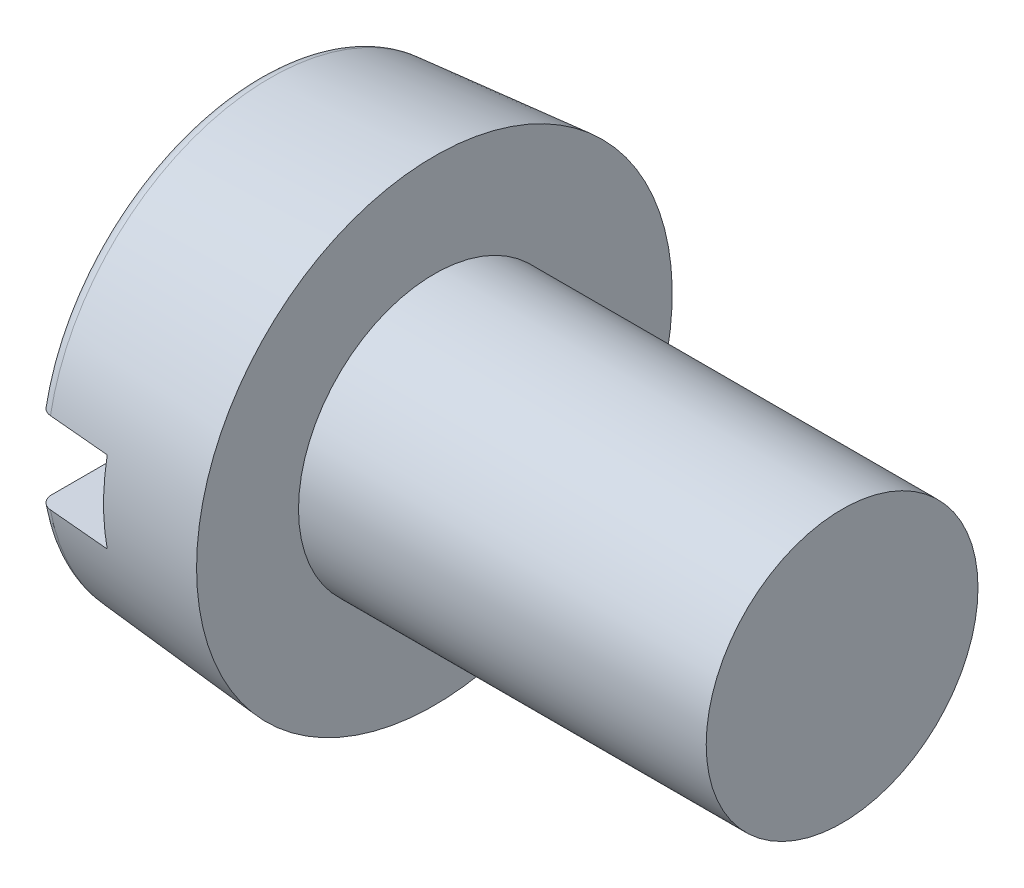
ISO-10303-21;
HEADER;
FILE_DESCRIPTION(('STEP AP214'),'2;1');
FILE_NAME('part.step','',(''),(''),'','','');
FILE_SCHEMA(('AUTOMOTIVE_DESIGN { 1 0 10303 214 1 1 1 1 }'));
ENDSEC;
DATA;
#1=APPLICATION_CONTEXT('core data for automotive mechanical design processes');
#2=APPLICATION_PROTOCOL_DEFINITION('international standard','automotive_design',2000,#1);
#3=PRODUCT_CONTEXT('',#1,'mechanical');
#4=PRODUCT('Part','Part','',(#3));
#5=PRODUCT_RELATED_PRODUCT_CATEGORY('part','',(#4));
#6=PRODUCT_DEFINITION_FORMATION('','',#4);
#7=PRODUCT_DEFINITION_CONTEXT('part definition',#1,'design');
#8=PRODUCT_DEFINITION('design','',#6,#7);
#9=PRODUCT_DEFINITION_SHAPE('','',#8);
#10=(LENGTH_UNIT() NAMED_UNIT(*) SI_UNIT(.MILLI.,.METRE.));
#11=(NAMED_UNIT(*) PLANE_ANGLE_UNIT() SI_UNIT($,.RADIAN.));
#12=(NAMED_UNIT(*) SI_UNIT($,.STERADIAN.) SOLID_ANGLE_UNIT());
#13=UNCERTAINTY_MEASURE_WITH_UNIT(LENGTH_MEASURE(1.E-05),#10,'distance_accuracy_value','');
#14=(GEOMETRIC_REPRESENTATION_CONTEXT(3) GLOBAL_UNCERTAINTY_ASSIGNED_CONTEXT((#13)) GLOBAL_UNIT_ASSIGNED_CONTEXT((#10,
#11,#12)) REPRESENTATION_CONTEXT('',''));
#15=CARTESIAN_POINT('',(0.,0.,0.));
#16=DIRECTION('',(0.,0.,1.));
#17=DIRECTION('',(1.,0.,0.));
#18=AXIS2_PLACEMENT_3D('',#15,#16,#17);
#19=CARTESIAN_POINT('',(0.,0.,0.));
#20=DIRECTION('',(-1.,0.,0.));
#21=DIRECTION('',(0.,0.,1.));
#22=AXIS2_PLACEMENT_3D('',#19,#20,#21);
#23=PLANE('',#22);
#24=DIRECTION('',(0.,0.,-1.));
#25=VECTOR('',#24,1.);
#26=CARTESIAN_POINT('',(0.,0.599999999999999,3.5));
#27=LINE('',#26,#25);
#28=CARTESIAN_POINT('',(0.,0.599999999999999,3.03043682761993));
#29=VERTEX_POINT('',#28);
#30=CARTESIAN_POINT('',(0.,0.599999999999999,-3.03043682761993));
#31=VERTEX_POINT('',#30);
#32=EDGE_CURVE('E110',#29,#31,#27,.T.);
#33=ORIENTED_EDGE('',*,*,#32,.F.);
#34=CARTESIAN_POINT('',(0.,0.,0.));
#35=DIRECTION('',(-1.,0.,0.));
#36=DIRECTION('',(0.,0.,1.));
#37=AXIS2_PLACEMENT_3D('',#34,#35,#36);
#38=CIRCLE('',#37,3.08926324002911);
#39=EDGE_CURVE('E112',#29,#31,#38,.T.);
#40=ORIENTED_EDGE('',*,*,#39,.T.);
#41=EDGE_LOOP('',(#33,#40));
#42=FACE_BOUND('',#41,.T.);
#43=ADVANCED_FACE('F41',(#42),#23,.T.);
#44=CARTESIAN_POINT('',(0.2,0.,0.));
#45=DIRECTION('',(-1.,0.,0.));
#46=DIRECTION('',(0.,0.,1.));
#47=AXIS2_PLACEMENT_3D('',#44,#45,#46);
#48=TOROIDAL_SURFACE('',#47,3.08926324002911,0.2);
#49=CARTESIAN_POINT('',(0.10595373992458,0.599999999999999,-3.21018161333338));
#50=CARTESIAN_POINT('',(0.115699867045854,0.599999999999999,-3.21546386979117));
#51=CARTESIAN_POINT('',(0.125895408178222,0.599999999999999,-3.21993251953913));
#52=CARTESIAN_POINT('',(0.146899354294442,0.599999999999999,-3.22710008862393));
#53=CARTESIAN_POINT('',(0.157708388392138,0.599999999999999,-3.22979715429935));
#54=CARTESIAN_POINT('',(0.179625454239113,0.599999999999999,-3.2333327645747));
#55=CARTESIAN_POINT('',(0.190733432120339,0.599999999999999,-3.23417164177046));
#56=CARTESIAN_POINT('',(0.212929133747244,0.599999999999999,-3.233964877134));
#57=CARTESIAN_POINT('',(0.224016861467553,0.599999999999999,-3.2329196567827));
#58=CARTESIAN_POINT('',(0.24582159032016,0.599999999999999,-3.22898503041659));
#59=CARTESIAN_POINT('',(0.256539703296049,0.599999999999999,-3.22610177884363));
#60=CARTESIAN_POINT('',(0.277343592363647,0.599999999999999,-3.21858540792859));
#61=CARTESIAN_POINT('',(0.287429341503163,0.599999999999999,-3.21395221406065));
#62=CARTESIAN_POINT('',(0.306739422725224,0.599999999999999,-3.20304847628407));
#63=CARTESIAN_POINT('',(0.315959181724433,0.599999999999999,-3.19676983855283));
#64=CARTESIAN_POINT('',(0.333231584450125,0.599999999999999,-3.18277301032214));
#65=CARTESIAN_POINT('',(0.341284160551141,0.599999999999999,-3.17505473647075));
#66=CARTESIAN_POINT('',(0.356112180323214,0.599999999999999,-3.15828860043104));
#67=CARTESIAN_POINT('',(0.362868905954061,0.599999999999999,-3.14922418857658));
#68=CARTESIAN_POINT('',(0.374794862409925,0.599999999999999,-3.13010544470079));
#69=CARTESIAN_POINT('',(0.379963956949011,0.599999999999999,-3.12005102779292));
#70=CARTESIAN_POINT('',(0.388661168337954,0.599999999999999,-3.09905295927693));
#71=CARTESIAN_POINT('',(0.392159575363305,0.599999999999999,-3.0880970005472));
#72=CARTESIAN_POINT('',(0.397296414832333,0.599999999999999,-3.06575733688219));
#73=CARTESIAN_POINT('',(0.398934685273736,0.599999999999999,-3.05437359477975));
#74=CARTESIAN_POINT('',(0.400323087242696,0.599999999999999,-3.03132781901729));
#75=CARTESIAN_POINT('',(0.40004590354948,0.599999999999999,-3.01966413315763));
#76=CARTESIAN_POINT('',(0.39754809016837,0.599999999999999,-2.9965463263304));
#77=CARTESIAN_POINT('',(0.39532736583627,0.599999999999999,-2.98509221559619));
#78=CARTESIAN_POINT('',(0.388983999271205,0.599999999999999,-2.96266069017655));
#79=CARTESIAN_POINT('',(0.384851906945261,0.599999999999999,-2.95168594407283));
#80=CARTESIAN_POINT('',(0.374790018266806,0.599999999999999,-2.93059330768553));
#81=CARTESIAN_POINT('',(0.368860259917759,0.599999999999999,-2.92047539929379));
#82=CARTESIAN_POINT('',(0.355413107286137,0.599999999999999,-2.90147355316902));
#83=CARTESIAN_POINT('',(0.347908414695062,0.599999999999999,-2.8925806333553));
#84=CARTESIAN_POINT('',(0.331487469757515,0.599999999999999,-2.87620998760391));
#85=CARTESIAN_POINT('',(0.322571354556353,0.599999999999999,-2.86873212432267));
#86=CARTESIAN_POINT('',(0.303753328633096,0.599999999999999,-2.85555292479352));
#87=CARTESIAN_POINT('',(0.293872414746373,0.599999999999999,-2.8498216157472));
#88=CARTESIAN_POINT('',(0.273273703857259,0.599999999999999,-2.84013920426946));
#89=CARTESIAN_POINT('',(0.262556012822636,0.599999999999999,-2.83618787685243));
#90=CARTESIAN_POINT('',(0.240822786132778,0.599999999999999,-2.83025814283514));
#91=CARTESIAN_POINT('',(0.229817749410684,0.599999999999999,-2.82824122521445));
#92=CARTESIAN_POINT('',(0.207625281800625,0.599999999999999,-2.82610837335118));
#93=CARTESIAN_POINT('',(0.196437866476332,0.599999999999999,-2.82599227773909));
#94=CARTESIAN_POINT('',(0.17433927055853,0.599999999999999,-2.82765455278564));
#95=CARTESIAN_POINT('',(0.163426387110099,0.599999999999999,-2.82941041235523));
#96=CARTESIAN_POINT('',(0.1420492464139,0.599999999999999,-2.83472469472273));
#97=CARTESIAN_POINT('',(0.131584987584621,0.599999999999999,-2.83828311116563));
#98=CARTESIAN_POINT('',(0.111366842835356,0.599999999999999,-2.8471025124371));
#99=CARTESIAN_POINT('',(0.101614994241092,0.599999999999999,-2.85236816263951));
#100=CARTESIAN_POINT('',(0.0831155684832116,0.599999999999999,-2.86443782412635));
#101=CARTESIAN_POINT('',(0.0743680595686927,0.599999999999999,-2.87124193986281));
#102=CARTESIAN_POINT('',(0.0579761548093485,0.599999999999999,-2.88630586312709));
#103=CARTESIAN_POINT('',(0.0503511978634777,0.599999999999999,-2.89458681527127));
#104=CARTESIAN_POINT('',(0.0365658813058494,0.599999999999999,-2.91228895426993));
#105=CARTESIAN_POINT('',(0.0304056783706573,0.599999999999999,-2.92171026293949));
#106=CARTESIAN_POINT('',(0.0195922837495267,0.599999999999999,-2.94163340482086));
#107=CARTESIAN_POINT('',(0.0149726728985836,0.599999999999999,-2.95215346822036));
#108=CARTESIAN_POINT('',(0.00753379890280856,0.599999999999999,-2.97381205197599));
#109=CARTESIAN_POINT('',(0.00471470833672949,0.599999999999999,-2.98495063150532));
#110=CARTESIAN_POINT('',(0.000917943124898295,0.599999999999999,-3.0077187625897));
#111=CARTESIAN_POINT('',(-2.99512472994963E-05,0.599999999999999,-3.01935328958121));
#112=CARTESIAN_POINT('',(3.13982112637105E-05,0.599999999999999,-3.04261715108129));
#113=CARTESIAN_POINT('',(0.00104065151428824,0.599999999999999,-3.05424648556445));
#114=CARTESIAN_POINT('',(0.00500199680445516,0.599999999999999,-3.077221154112));
#115=CARTESIAN_POINT('',(0.00796235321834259,0.599999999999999,-3.08856506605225));
#116=CARTESIAN_POINT('',(0.0157616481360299,0.599999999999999,-3.11059162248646));
#117=CARTESIAN_POINT('',(0.0206009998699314,0.599999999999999,-3.12127412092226));
#118=CARTESIAN_POINT('',(0.0319873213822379,0.599999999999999,-3.14158024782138));
#119=CARTESIAN_POINT('',(0.0385211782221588,0.599999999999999,-3.15121123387));
#120=CARTESIAN_POINT('',(0.0531333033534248,0.599999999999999,-3.16920723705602));
#121=CARTESIAN_POINT('',(0.0612095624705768,0.599999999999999,-3.17757387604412));
#122=CARTESIAN_POINT('',(0.0754611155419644,0.599999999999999,-3.18998949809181));
#123=CARTESIAN_POINT('',(0.0812448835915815,0.599999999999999,-3.1944955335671));
#124=CARTESIAN_POINT('',(0.0932716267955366,0.599999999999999,-3.20284662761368));
#125=CARTESIAN_POINT('',(0.0995145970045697,0.599999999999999,-3.2066916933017));
#126=CARTESIAN_POINT('',(0.10595373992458,0.599999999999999,-3.21018161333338));
#127=B_SPLINE_CURVE_WITH_KNOTS('',3,(#49,#50,#51,#52,#53,#54,#55,#56,#57,#58,#59,#60,#61,#62,
#63,#64,#65,#66,#67,#68,#69,#70,#71,#72,#73,#74,#75,#76,#77,#78,#79,#80,#81,#82,#83,#84,#85,#86,
#87,#88,#89,#90,#91,#92,#93,#94,#95,#96,#97,#98,#99,#100,#101,#102,#103,#104,#105,#106,#107,
#108,#109,#110,#111,#112,#113,#114,#115,#116,#117,#118,#119,#120,#121,#122,#123,#124,#125,#126),
.UNSPECIFIED.,.T.,.F.,(4,2,2,2,2,2,2,2,2,2,2,2,2,2,2,2,2,2,2,2,2,2,2,2,2,2,2,2,2,2,2,2,2,2,2,2,
2,2,4),(0.,0.0332301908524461,0.0664950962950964,0.0997540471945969,0.133005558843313,
0.16614631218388,0.199288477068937,0.232596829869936,0.265907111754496,0.29966728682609,
0.333430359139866,0.367773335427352,0.402119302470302,0.436956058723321,0.471794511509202,
0.506807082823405,0.541818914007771,0.576558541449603,0.611294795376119,0.645396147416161,
0.679493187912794,0.712896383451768,0.746296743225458,0.779299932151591,0.812303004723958,
0.845397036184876,0.87849331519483,0.912108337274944,0.945726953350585,0.980036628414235,
1.01434959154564,1.04920438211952,1.08405934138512,1.11906289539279,1.15407415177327,
1.18882216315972,1.22352521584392,1.245480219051,1.26743498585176),.UNSPECIFIED.);
#128=CARTESIAN_POINT('',(0.182568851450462,0.599999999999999,-3.23330273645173));
#129=VERTEX_POINT('',#128);
#130=EDGE_CURVE('E65',#31,#129,#127,.T.);
#131=ORIENTED_EDGE('',*,*,#130,.F.);
#132=ORIENTED_EDGE('',*,*,#39,.F.);
#133=CARTESIAN_POINT('',(0.105016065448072,0.599999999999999,2.85080142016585));
#134=CARTESIAN_POINT('',(0.114691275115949,0.599999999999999,2.84546620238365));
#135=CARTESIAN_POINT('',(0.12481865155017,0.599999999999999,2.84093609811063));
#136=CARTESIAN_POINT('',(0.145696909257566,0.599999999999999,2.83363379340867));
#137=CARTESIAN_POINT('',(0.156448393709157,0.599999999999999,2.83086332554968));
#138=CARTESIAN_POINT('',(0.178265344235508,0.599999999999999,2.82717406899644));
#139=CARTESIAN_POINT('',(0.189330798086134,0.599999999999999,2.82625520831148));
#140=CARTESIAN_POINT('',(0.211455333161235,0.599999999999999,2.82629971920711));
#141=CARTESIAN_POINT('',(0.222514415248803,0.599999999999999,2.82726268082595));
#142=CARTESIAN_POINT('',(0.24425666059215,0.599999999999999,2.83102874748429));
#143=CARTESIAN_POINT('',(0.254941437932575,0.599999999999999,2.833822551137));
#144=CARTESIAN_POINT('',(0.27569543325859,0.599999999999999,2.84115235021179));
#145=CARTESIAN_POINT('',(0.285764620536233,0.599999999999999,2.84568843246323));
#146=CARTESIAN_POINT('',(0.305080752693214,0.599999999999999,2.85639977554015));
#147=CARTESIAN_POINT('',(0.314321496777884,0.599999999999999,2.86258620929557));
#148=CARTESIAN_POINT('',(0.331656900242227,0.599999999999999,2.87639692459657));
#149=CARTESIAN_POINT('',(0.339751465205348,0.599999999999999,2.88402132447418));
#150=CARTESIAN_POINT('',(0.354722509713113,0.599999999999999,2.90063675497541));
#151=CARTESIAN_POINT('',(0.361574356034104,0.599999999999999,2.90964997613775));
#152=CARTESIAN_POINT('',(0.373703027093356,0.599999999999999,2.92868002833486));
#153=CARTESIAN_POINT('',(0.378979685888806,0.599999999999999,2.93869696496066));
#154=CARTESIAN_POINT('',(0.387916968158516,0.599999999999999,2.95966673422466));
#155=CARTESIAN_POINT('',(0.391542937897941,0.599999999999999,2.97063434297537));
#156=CARTESIAN_POINT('',(0.396928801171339,0.599999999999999,2.99301875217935));
#157=CARTESIAN_POINT('',(0.398688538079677,0.599999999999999,3.00443559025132));
#158=CARTESIAN_POINT('',(0.40030679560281,0.599999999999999,3.02755271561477));
#159=CARTESIAN_POINT('',(0.400140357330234,0.599999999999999,3.03925475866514));
#160=CARTESIAN_POINT('',(0.397847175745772,0.599999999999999,3.06246562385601));
#161=CARTESIAN_POINT('',(0.395720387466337,0.599999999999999,3.07397444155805));
#162=CARTESIAN_POINT('',(0.389555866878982,0.599999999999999,3.09647750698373));
#163=CARTESIAN_POINT('',(0.385516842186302,0.599999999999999,3.1074714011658));
#164=CARTESIAN_POINT('',(0.375630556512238,0.599999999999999,3.12861423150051));
#165=CARTESIAN_POINT('',(0.369783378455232,0.599999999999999,3.13876320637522));
#166=CARTESIAN_POINT('',(0.356510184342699,0.599999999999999,3.15780612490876));
#167=CARTESIAN_POINT('',(0.349102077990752,0.599999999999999,3.1667125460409));
#168=CARTESIAN_POINT('',(0.332872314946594,0.599999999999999,3.18312834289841));
#169=CARTESIAN_POINT('',(0.324050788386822,0.599999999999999,3.19063784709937));
#170=CARTESIAN_POINT('',(0.305405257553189,0.599999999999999,3.20390997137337));
#171=CARTESIAN_POINT('',(0.295600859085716,0.599999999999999,3.20970013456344));
#172=CARTESIAN_POINT('',(0.275147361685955,0.599999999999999,3.21952148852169));
#173=CARTESIAN_POINT('',(0.264498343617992,0.599999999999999,3.22355284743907));
#174=CARTESIAN_POINT('',(0.242839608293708,0.599999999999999,3.22967901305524));
#175=CARTESIAN_POINT('',(0.231838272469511,0.599999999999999,3.23180347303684));
#176=CARTESIAN_POINT('',(0.209634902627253,0.599999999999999,3.2341574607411));
#177=CARTESIAN_POINT('',(0.198432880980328,0.599999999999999,3.23438710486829));
#178=CARTESIAN_POINT('',(0.176248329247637,0.599999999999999,3.23295068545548));
#179=CARTESIAN_POINT('',(0.165264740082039,0.599999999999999,3.23130090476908));
#180=CARTESIAN_POINT('',(0.143729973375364,0.599999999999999,3.22618337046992));
#181=CARTESIAN_POINT('',(0.133178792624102,0.599999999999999,3.22271563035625));
#182=CARTESIAN_POINT('',(0.112787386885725,0.599999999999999,3.21406153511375));
#183=CARTESIAN_POINT('',(0.102948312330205,0.599999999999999,3.20887247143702));
#184=CARTESIAN_POINT('',(0.0842683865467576,0.599999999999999,3.19693335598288));
#185=CARTESIAN_POINT('',(0.0754275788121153,0.599999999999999,3.19018323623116));
#186=CARTESIAN_POINT('',(0.0588875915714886,0.599999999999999,3.17523730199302));
#187=CARTESIAN_POINT('',(0.0512021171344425,0.599999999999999,3.16702632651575));
#188=CARTESIAN_POINT('',(0.0372916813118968,0.599999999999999,3.14944895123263));
#189=CARTESIAN_POINT('',(0.0310668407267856,0.599999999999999,3.14008245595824));
#190=CARTESIAN_POINT('',(0.0201439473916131,0.599999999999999,3.1202940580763));
#191=CARTESIAN_POINT('',(0.0154729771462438,0.599999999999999,3.10985720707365));
#192=CARTESIAN_POINT('',(0.00791811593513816,0.599999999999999,3.08835564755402));
#193=CARTESIAN_POINT('',(0.00503438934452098,0.599999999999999,3.07729088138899));
#194=CARTESIAN_POINT('',(0.00109145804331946,0.599999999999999,3.05465747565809));
#195=CARTESIAN_POINT('',(6.22854021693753E-05,0.599999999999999,3.04308359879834));
#196=CARTESIAN_POINT('',(-5.67976142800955E-05,0.599999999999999,3.01992599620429));
#197=CARTESIAN_POINT('',(0.000853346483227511,0.599999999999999,3.00834227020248));
#198=CARTESIAN_POINT('',(0.00460421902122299,0.599999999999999,2.98538851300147));
#199=CARTESIAN_POINT('',(0.00746152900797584,0.599999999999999,2.97402118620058));
#200=CARTESIAN_POINT('',(0.0150510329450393,0.599999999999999,2.95192660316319));
#201=CARTESIAN_POINT('',(0.0197836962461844,0.599999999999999,2.94119950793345));
#202=CARTESIAN_POINT('',(0.0309827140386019,0.599999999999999,2.92073316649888));
#203=CARTESIAN_POINT('',(0.0374439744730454,0.599999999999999,2.91099113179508));
#204=CARTESIAN_POINT('',(0.0519300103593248,0.599999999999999,2.89276112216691));
#205=CARTESIAN_POINT('',(0.0599527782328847,0.599999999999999,2.88427156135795));
#206=CARTESIAN_POINT('',(0.0742017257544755,0.599999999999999,2.87159228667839));
#207=CARTESIAN_POINT('',(0.080035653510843,0.599999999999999,2.86695454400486));
#208=CARTESIAN_POINT('',(0.0921833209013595,0.599999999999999,2.85835650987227));
#209=CARTESIAN_POINT('',(0.0984970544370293,0.599999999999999,2.85439620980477));
#210=CARTESIAN_POINT('',(0.105016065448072,0.599999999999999,2.85080142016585));
#211=B_SPLINE_CURVE_WITH_KNOTS('',3,(#133,#134,#135,#136,#137,#138,#139,#140,#141,#142,#143,
#144,#145,#146,#147,#148,#149,#150,#151,#152,#153,#154,#155,#156,#157,#158,#159,#160,#161,#162,
#163,#164,#165,#166,#167,#168,#169,#170,#171,#172,#173,#174,#175,#176,#177,#178,#179,#180,#181,
#182,#183,#184,#185,#186,#187,#188,#189,#190,#191,#192,#193,#194,#195,#196,#197,#198,#199,#200,
#201,#202,#203,#204,#205,#206,#207,#208,#209,#210),.UNSPECIFIED.,.T.,.F.,(4,2,2,2,2,2,2,2,2,2,2,
2,2,2,2,2,2,2,2,2,2,2,2,2,2,2,2,2,2,2,2,2,2,2,2,2,2,2,4),(0.,0.0331194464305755,
0.066271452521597,0.0994221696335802,0.132565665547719,0.165542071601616,0.198520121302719,
0.23172736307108,0.264937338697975,0.298746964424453,0.332560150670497,0.367053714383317,
0.401550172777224,0.436494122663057,0.471438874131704,0.506407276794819,0.541374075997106,
0.575959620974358,0.610541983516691,0.644536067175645,0.678526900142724,0.711979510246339,
0.745430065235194,0.778593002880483,0.811755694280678,0.844970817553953,0.878187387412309,
0.91177126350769,0.945357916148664,0.979502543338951,1.01365031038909,1.04834624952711,
1.08304316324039,1.11803930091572,1.15304420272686,1.18794706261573,1.22280534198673,
1.24512101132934,1.26743639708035),.UNSPECIFIED.);
#212=CARTESIAN_POINT('',(0.182568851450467,0.599999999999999,3.23330273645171));
#213=VERTEX_POINT('',#212);
#214=EDGE_CURVE('E102',#213,#29,#211,.T.);
#215=ORIENTED_EDGE('',*,*,#214,.F.);
#216=CARTESIAN_POINT('',(0.182568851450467,0.,0.));
#217=DIRECTION('',(-1.,0.,0.));
#218=DIRECTION('',(0.,0.,1.));
#219=AXIS2_PLACEMENT_3D('',#216,#217,#218);
#220=CIRCLE('',#219,3.28850217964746);
#221=EDGE_CURVE('E116',#129,#213,#220,.F.);
#222=ORIENTED_EDGE('',*,*,#221,.F.);
#223=EDGE_LOOP('',(#131,#132,#215,#222));
#224=FACE_BOUND('',#223,.T.);
#225=ADVANCED_FACE('F187',(#224),#48,.T.);
#226=CARTESIAN_POINT('',(-25.4,0.,0.));
#227=DIRECTION('',(-1.,0.,0.));
#228=DIRECTION('',(0.,0.,1.));
#229=AXIS2_PLACEMENT_3D('',#226,#227,#228);
#230=CYLINDRICAL_SURFACE('',#229,2.);
#231=CARTESIAN_POINT('',(8.6,0.,0.));
#232=DIRECTION('',(-1.,0.,0.));
#233=DIRECTION('',(0.,0.,1.));
#234=AXIS2_PLACEMENT_3D('',#231,#232,#233);
#235=CIRCLE('',#234,2.);
#236=CARTESIAN_POINT('',(8.6,0.,2.));
#237=VERTEX_POINT('',#236);
#238=EDGE_CURVE('E113',#237,#237,#235,.T.);
#239=ORIENTED_EDGE('',*,*,#238,.T.);
#240=EDGE_LOOP('',(#239));
#241=FACE_BOUND('',#240,.T.);
#242=CARTESIAN_POINT('',(2.6,0.,0.));
#243=DIRECTION('',(-1.,0.,0.));
#244=DIRECTION('',(0.,0.,1.));
#245=AXIS2_PLACEMENT_3D('',#242,#243,#244);
#246=CIRCLE('',#245,2.);
#247=CARTESIAN_POINT('',(2.6,0.,2.));
#248=VERTEX_POINT('',#247);
#249=EDGE_CURVE('E174',#248,#248,#246,.T.);
#250=ORIENTED_EDGE('',*,*,#249,.F.);
#251=EDGE_LOOP('',(#250));
#252=FACE_BOUND('',#251,.T.);
#253=ADVANCED_FACE('F184',(#241,#252),#230,.T.);
#254=CARTESIAN_POINT('',(8.6,2.,0.));
#255=DIRECTION('',(1.,0.,0.));
#256=DIRECTION('',(0.,0.,-1.));
#257=AXIS2_PLACEMENT_3D('',#254,#255,#256);
#258=PLANE('',#257);
#259=ORIENTED_EDGE('',*,*,#238,.F.);
#260=EDGE_LOOP('',(#259));
#261=FACE_BOUND('',#260,.T.);
#262=ADVANCED_FACE('F186',(#261),#258,.T.);
#263=DIRECTION('',(0.,0.,1.));
#264=VECTOR('',#263,1.);
#265=CARTESIAN_POINT('',(0.,-0.599999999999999,-3.5));
#266=LINE('',#265,#264);
#267=CARTESIAN_POINT('',(0.,-0.599999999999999,-3.03043682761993));
#268=VERTEX_POINT('',#267);
#269=CARTESIAN_POINT('',(0.,-0.6,3.03043682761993));
#270=VERTEX_POINT('',#269);
#271=EDGE_CURVE('E57',#268,#270,#266,.T.);
#272=ORIENTED_EDGE('',*,*,#271,.F.);
#273=EDGE_CURVE('E108',#268,#270,#38,.T.);
#274=ORIENTED_EDGE('',*,*,#273,.T.);
#275=EDGE_LOOP('',(#272,#274));
#276=FACE_BOUND('',#275,.T.);
#277=ADVANCED_FACE('F107',(#276),#23,.T.);
#278=CARTESIAN_POINT('',(0.,0.,0.));
#279=DIRECTION('',(1.,0.,0.));
#280=DIRECTION('',(0.,0.,-1.));
#281=AXIS2_PLACEMENT_3D('',#278,#279,#280);
#282=CONICAL_SURFACE('',#281,3.2725294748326,0.0872664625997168);
#283=CARTESIAN_POINT('',(-5.50655611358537,0.599999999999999,-2.72550680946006));
#284=CARTESIAN_POINT('',(-3.80202221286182,0.599999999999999,-2.87818079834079));
#285=CARTESIAN_POINT('',(-2.0974409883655,0.599999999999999,-3.03032472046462));
#286=CARTESIAN_POINT('',(-0.067381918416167,0.599999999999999,-3.2110638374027));
#287=CARTESIAN_POINT('',(0.258063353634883,0.599999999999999,-3.24002475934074));
#288=CARTESIAN_POINT('',(2.61358356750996,0.599999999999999,-3.44954593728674));
#289=CARTESIAN_POINT('',(4.64370165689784,0.599999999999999,-3.62962140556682));
#290=CARTESIAN_POINT('',(6.67384119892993,0.599999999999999,-3.80945351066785));
#291=B_SPLINE_CURVE_WITH_KNOTS('',3,(#283,#284,#285,#286,#287,#288,#289,#290),.UNSPECIFIED.,.F.,
.F.,(4,2,2,4),(0.,5.13407279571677,6.11426677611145,12.2285333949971),.UNSPECIFIED.);
#292=CARTESIAN_POINT('',(1.1,0.599999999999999,-3.31490439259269));
#293=VERTEX_POINT('',#292);
#294=EDGE_CURVE('E169',#129,#293,#291,.T.);
#295=ORIENTED_EDGE('',*,*,#294,.F.);
#296=ORIENTED_EDGE('',*,*,#221,.T.);
#297=CARTESIAN_POINT('',(6.67384119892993,0.599999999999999,3.80945351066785));
#298=CARTESIAN_POINT('',(5.65877031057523,0.599999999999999,3.7195495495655));
#299=CARTESIAN_POINT('',(4.64370583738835,0.599999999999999,3.62957307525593));
#300=CARTESIAN_POINT('',(2.6135939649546,0.599999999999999,3.44942842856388));
#301=CARTESIAN_POINT('',(1.59854656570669,0.599999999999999,3.359260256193));
#302=CARTESIAN_POINT('',(-0.431527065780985,0.599999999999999,3.17868552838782));
#303=CARTESIAN_POINT('',(-1.44655329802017,0.599999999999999,3.088278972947));
#304=CARTESIAN_POINT('',(-3.47657760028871,0.599999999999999,2.90714957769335));
#305=CARTESIAN_POINT('',(-4.49157567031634,0.599999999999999,2.81642673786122));
#306=CARTESIAN_POINT('',(-5.50655611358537,0.599999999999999,2.72550680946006));
#307=B_SPLINE_CURVE_WITH_KNOTS('',3,(#297,#298,#299,#300,#301,#302,#303,#304,#305,#306),
.UNSPECIFIED.,.F.,.F.,(4,2,2,2,4),(0.,3.05713341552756,6.11426664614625,9.17139996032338,
12.2285334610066),.UNSPECIFIED.);
#308=CARTESIAN_POINT('',(1.1,0.599999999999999,3.31490439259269));
#309=VERTEX_POINT('',#308);
#310=EDGE_CURVE('E165',#309,#213,#307,.T.);
#311=ORIENTED_EDGE('',*,*,#310,.F.);
#312=CARTESIAN_POINT('',(1.1,0.,0.));
#313=DIRECTION('',(-1.,0.,0.));
#314=DIRECTION('',(0.,0.,1.));
#315=AXIS2_PLACEMENT_3D('',#312,#313,#314);
#316=CIRCLE('',#315,3.36876700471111);
#317=CARTESIAN_POINT('',(1.1,-0.6,3.31490439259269));
#318=VERTEX_POINT('',#317);
#319=EDGE_CURVE('E46',#309,#318,#316,.F.);
#320=ORIENTED_EDGE('',*,*,#319,.T.);
#321=CARTESIAN_POINT('',(-5.50655611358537,-0.6,2.72550680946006));
#322=CARTESIAN_POINT('',(-3.80202221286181,-0.6,2.87818079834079));
#323=CARTESIAN_POINT('',(-2.0974409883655,-0.6,3.03032472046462));
#324=CARTESIAN_POINT('',(-0.0673819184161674,-0.6,3.2110638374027));
#325=CARTESIAN_POINT('',(0.258063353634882,-0.6,3.24002475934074));
#326=CARTESIAN_POINT('',(2.61358356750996,-0.6,3.44954593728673));
#327=CARTESIAN_POINT('',(4.64370165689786,-0.6,3.62962140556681));
#328=CARTESIAN_POINT('',(6.67384119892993,-0.6,3.80945351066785));
#329=B_SPLINE_CURVE_WITH_KNOTS('',3,(#321,#322,#323,#324,#325,#326,#327,#328),.UNSPECIFIED.,.F.,
.F.,(4,2,2,4),(0.,5.13407279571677,6.11426677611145,12.2285333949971),.UNSPECIFIED.);
#330=CARTESIAN_POINT('',(0.182568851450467,-0.6,3.23330273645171));
#331=VERTEX_POINT('',#330);
#332=EDGE_CURVE('E143',#331,#318,#329,.T.);
#333=ORIENTED_EDGE('',*,*,#332,.F.);
#334=CARTESIAN_POINT('',(0.182568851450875,-0.599999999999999,-3.23330273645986));
#335=VERTEX_POINT('',#334);
#336=EDGE_CURVE('E122',#331,#335,#220,.F.);
#337=ORIENTED_EDGE('',*,*,#336,.T.);
#338=CARTESIAN_POINT('',(6.67384119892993,-0.599999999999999,-3.80945351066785));
#339=CARTESIAN_POINT('',(5.65877031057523,-0.599999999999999,-3.7195495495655));
#340=CARTESIAN_POINT('',(4.64370583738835,-0.599999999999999,-3.62957307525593));
#341=CARTESIAN_POINT('',(2.6135939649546,-0.599999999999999,-3.44942842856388));
#342=CARTESIAN_POINT('',(1.59854656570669,-0.599999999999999,-3.359260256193));
#343=CARTESIAN_POINT('',(-0.431527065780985,-0.599999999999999,-3.17868552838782));
#344=CARTESIAN_POINT('',(-1.44655329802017,-0.6,-3.088278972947));
#345=CARTESIAN_POINT('',(-3.47657760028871,-0.6,-2.90714957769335));
#346=CARTESIAN_POINT('',(-4.49157567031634,-0.6,-2.81642673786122));
#347=CARTESIAN_POINT('',(-5.50655611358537,-0.6,-2.72550680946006));
#348=B_SPLINE_CURVE_WITH_KNOTS('',3,(#338,#339,#340,#341,#342,#343,#344,#345,#346,#347),
.UNSPECIFIED.,.F.,.F.,(4,2,2,2,4),(0.,3.05713341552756,6.11426664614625,9.17139996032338,
12.2285334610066),.UNSPECIFIED.);
#349=CARTESIAN_POINT('',(1.1,-0.599999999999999,-3.31490439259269));
#350=VERTEX_POINT('',#349);
#351=EDGE_CURVE('E97',#350,#335,#348,.T.);
#352=ORIENTED_EDGE('',*,*,#351,.F.);
#353=EDGE_CURVE('E11',#350,#293,#316,.F.);
#354=ORIENTED_EDGE('',*,*,#353,.T.);
#355=EDGE_LOOP('',(#295,#296,#311,#320,#333,#337,#352,#354));
#356=FACE_BOUND('',#355,.T.);
#357=CARTESIAN_POINT('',(2.6,0.,0.));
#358=DIRECTION('',(-1.,0.,0.));
#359=DIRECTION('',(0.,0.,1.));
#360=AXIS2_PLACEMENT_3D('',#357,#358,#359);
#361=CIRCLE('',#360,3.5);
#362=CARTESIAN_POINT('',(2.6,0.,3.5));
#363=VERTEX_POINT('',#362);
#364=EDGE_CURVE('E118',#363,#363,#361,.T.);
#365=ORIENTED_EDGE('',*,*,#364,.T.);
#366=EDGE_LOOP('',(#365));
#367=FACE_BOUND('',#366,.T.);
#368=ADVANCED_FACE('F154',(#356,#367),#282,.T.);
#369=CARTESIAN_POINT('',(2.6,2.,0.));
#370=DIRECTION('',(-1.,0.,0.));
#371=DIRECTION('',(0.,0.,1.));
#372=AXIS2_PLACEMENT_3D('',#369,#370,#371);
#373=PLANE('',#372);
#374=ORIENTED_EDGE('',*,*,#364,.F.);
#375=EDGE_LOOP('',(#374));
#376=FACE_BOUND('',#375,.T.);
#377=ORIENTED_EDGE('',*,*,#249,.T.);
#378=EDGE_LOOP('',(#377));
#379=FACE_BOUND('',#378,.T.);
#380=ADVANCED_FACE('F158',(#376,#379),#373,.F.);
#381=CARTESIAN_POINT('',(0.10595373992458,-0.599999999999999,-3.21018161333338));
#382=CARTESIAN_POINT('',(0.0960146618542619,-0.599999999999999,-3.20479360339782));
#383=CARTESIAN_POINT('',(0.0865284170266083,-0.599999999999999,-3.19855129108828));
#384=CARTESIAN_POINT('',(0.0687367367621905,-0.599999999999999,-3.18455028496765));
#385=CARTESIAN_POINT('',(0.0604329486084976,-0.599999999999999,-3.17678951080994));
#386=CARTESIAN_POINT('',(0.0452497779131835,-0.599999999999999,-3.15999804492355));
#387=CARTESIAN_POINT('',(0.0383686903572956,-0.599999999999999,-3.15096889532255));
#388=CARTESIAN_POINT('',(0.0261997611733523,-0.599999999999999,-3.13189878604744));
#389=CARTESIAN_POINT('',(0.0209115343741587,-0.599999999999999,-3.12185807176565));
#390=CARTESIAN_POINT('',(0.0120001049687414,-0.599999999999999,-3.10091081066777));
#391=CARTESIAN_POINT('',(0.00839912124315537,-0.599999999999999,-3.08999481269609));
#392=CARTESIAN_POINT('',(0.00305136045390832,-0.599999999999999,-3.06771714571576));
#393=CARTESIAN_POINT('',(0.00130482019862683,-0.599999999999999,-3.0563554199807));
#394=CARTESIAN_POINT('',(-0.000304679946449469,-0.599999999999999,-3.03333344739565));
#395=CARTESIAN_POINT('',(-0.000139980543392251,-0.599999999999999,-3.02167126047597));
#396=CARTESIAN_POINT('',(0.00213350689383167,-0.599999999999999,-2.99853754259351));
#397=CARTESIAN_POINT('',(0.00424239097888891,-0.6,-2.9870660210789));
#398=CARTESIAN_POINT('',(0.0103660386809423,-0.6,-2.96457689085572));
#399=CARTESIAN_POINT('',(0.0143909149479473,-0.6,-2.95356203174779));
#400=CARTESIAN_POINT('',(0.0242460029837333,-0.6,-2.93237123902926));
#401=CARTESIAN_POINT('',(0.0300761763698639,-0.6,-2.92219528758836));
#402=CARTESIAN_POINT('',(0.0433378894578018,-0.6,-2.90305748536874));
#403=CARTESIAN_POINT('',(0.0507572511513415,-0.6,-2.89408720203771));
#404=CARTESIAN_POINT('',(0.0670217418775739,-0.6,-2.87754799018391));
#405=CARTESIAN_POINT('',(0.0758667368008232,-0.6,-2.86997892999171));
#406=CARTESIAN_POINT('',(0.0945622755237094,-0.6,-2.85660637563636));
#407=CARTESIAN_POINT('',(0.104391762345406,-0.6,-2.85077345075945));
#408=CARTESIAN_POINT('',(0.124905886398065,-0.6,-2.8408806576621));
#409=CARTESIAN_POINT('',(0.135590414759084,-0.6,-2.8368205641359));
#410=CARTESIAN_POINT('',(0.157276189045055,-0.6,-2.83067225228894));
#411=CARTESIAN_POINT('',(0.168266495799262,-0.6,-2.82854542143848));
#412=CARTESIAN_POINT('',(0.190448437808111,-0.6,-2.82619258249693));
#413=CARTESIAN_POINT('',(0.2016400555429,-0.6,-2.82596640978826));
#414=CARTESIAN_POINT('',(0.223761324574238,-0.6,-2.82741304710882));
#415=CARTESIAN_POINT('',(0.234692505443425,-0.6,-2.82906261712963));
#416=CARTESIAN_POINT('',(0.256123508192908,-0.6,-2.83416971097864));
#417=CARTESIAN_POINT('',(0.266623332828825,-0.6,-2.83762722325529));
#418=CARTESIAN_POINT('',(0.286924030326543,-0.6,-2.84625101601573));
#419=CARTESIAN_POINT('',(0.296723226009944,-0.6,-2.85142124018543));
#420=CARTESIAN_POINT('',(0.315332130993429,-0.6,-2.86330962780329));
#421=CARTESIAN_POINT('',(0.324141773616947,-0.6,-2.87002789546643));
#422=CARTESIAN_POINT('',(0.340669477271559,-0.6,-2.88492851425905));
#423=CARTESIAN_POINT('',(0.348368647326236,-0.6,-2.89313181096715));
#424=CARTESIAN_POINT('',(0.362314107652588,-0.6,-2.91069187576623));
#425=CARTESIAN_POINT('',(0.368560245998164,-0.6,-2.92004876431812));
#426=CARTESIAN_POINT('',(0.379556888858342,-0.6,-2.93985667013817));
#427=CARTESIAN_POINT('',(0.384274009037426,-0.6,-2.95032622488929));
#428=CARTESIAN_POINT('',(0.391915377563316,-0.6,-2.97190043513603));
#429=CARTESIAN_POINT('',(0.394839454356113,-0.6,-2.98300515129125));
#430=CARTESIAN_POINT('',(0.398853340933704,-0.6,-3.00572547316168));
#431=CARTESIAN_POINT('',(0.399913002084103,-0.599999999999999,-3.01734641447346));
#432=CARTESIAN_POINT('',(0.400076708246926,-0.599999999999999,-3.040602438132));
#433=CARTESIAN_POINT('',(0.399180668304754,-0.599999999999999,-3.05223752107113));
#434=CARTESIAN_POINT('',(0.395443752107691,-0.599999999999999,-3.07524842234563));
#435=CARTESIAN_POINT('',(0.392593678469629,-0.599999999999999,-3.08662275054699));
#436=CARTESIAN_POINT('',(0.385009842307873,-0.599999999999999,-3.10872565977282));
#437=CARTESIAN_POINT('',(0.380276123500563,-0.599999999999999,-3.11945425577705));
#438=CARTESIAN_POINT('',(0.369091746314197,-0.599999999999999,-3.13986909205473));
#439=CARTESIAN_POINT('',(0.362654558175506,-0.599999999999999,-3.1495627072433));
#440=CARTESIAN_POINT('',(0.348219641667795,-0.599999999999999,-3.16770913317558));
#441=CARTESIAN_POINT('',(0.340222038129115,-0.599999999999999,-3.17616204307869));
#442=CARTESIAN_POINT('',(0.323027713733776,-0.599999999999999,-3.19144232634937));
#443=CARTESIAN_POINT('',(0.313851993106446,-0.599999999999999,-3.19829332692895));
#444=CARTESIAN_POINT('',(0.294464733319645,-0.599999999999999,-3.21032583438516));
#445=CARTESIAN_POINT('',(0.284253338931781,-0.599999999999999,-3.2155075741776));
#446=CARTESIAN_POINT('',(0.263272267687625,-0.599999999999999,-3.22396402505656));
#447=CARTESIAN_POINT('',(0.252515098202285,-0.599999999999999,-3.22726978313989));
#448=CARTESIAN_POINT('',(0.230592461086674,-0.599999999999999,-3.23200581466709));
#449=CARTESIAN_POINT('',(0.219426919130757,-0.599999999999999,-3.23343574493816));
#450=CARTESIAN_POINT('',(0.197138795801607,-0.599999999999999,-3.23436881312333));
#451=CARTESIAN_POINT('',(0.186017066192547,-0.599999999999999,-3.23389272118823));
#452=CARTESIAN_POINT('',(0.164022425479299,-0.599999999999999,-3.23107504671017));
#453=CARTESIAN_POINT('',(0.153149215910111,-0.599999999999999,-3.22873583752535));
#454=CARTESIAN_POINT('',(0.136218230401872,-0.599999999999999,-3.2235728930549));
#455=CARTESIAN_POINT('',(0.129980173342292,-0.599999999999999,-3.22132097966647));
#456=CARTESIAN_POINT('',(0.117760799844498,-0.599999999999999,-3.21620441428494));
#457=CARTESIAN_POINT('',(0.11177948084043,-0.599999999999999,-3.21333976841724));
#458=CARTESIAN_POINT('',(0.10595373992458,-0.599999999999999,-3.21018161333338));
#459=B_SPLINE_CURVE_WITH_KNOTS('',3,(#381,#382,#383,#384,#385,#386,#387,#388,#389,#390,#391,
#392,#393,#394,#395,#396,#397,#398,#399,#400,#401,#402,#403,#404,#405,#406,#407,#408,#409,#410,
#411,#412,#413,#414,#415,#416,#417,#418,#419,#420,#421,#422,#423,#424,#425,#426,#427,#428,#429,
#430,#431,#432,#433,#434,#435,#436,#437,#438,#439,#440,#441,#442,#443,#444,#445,#446,#447,#448,
#449,#450,#451,#452,#453,#454,#455,#456,#457,#458),.UNSPECIFIED.,.T.,.F.,(4,2,2,2,2,2,2,2,2,2,2,
2,2,2,2,2,2,2,2,2,2,2,2,2,2,2,2,2,2,2,2,2,2,2,2,2,2,2,4),(0.,0.0338920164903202,
0.0678307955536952,0.10172866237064,0.135618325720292,0.169942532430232,0.204271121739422,
0.239097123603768,0.273924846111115,0.308938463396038,0.343951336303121,0.378704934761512,
0.413455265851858,0.447577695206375,0.481695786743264,0.51511643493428,0.548534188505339,
0.58154237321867,0.61455034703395,0.647634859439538,0.680721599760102,0.714317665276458,
0.74791724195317,0.782207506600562,0.816501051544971,0.851344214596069,0.886188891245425,
0.921198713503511,0.956207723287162,0.990947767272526,1.02568503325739,1.05987207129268,
1.09405433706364,1.12765303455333,1.16125787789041,1.19449752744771,1.22769490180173,
1.24756073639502,1.26742637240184),.UNSPECIFIED.);
#460=EDGE_CURVE('E93',#335,#268,#459,.T.);
#461=ORIENTED_EDGE('',*,*,#460,.F.);
#462=ORIENTED_EDGE('',*,*,#336,.F.);
#463=CARTESIAN_POINT('',(0.105016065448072,-0.6,2.85080142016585));
#464=CARTESIAN_POINT('',(0.0950844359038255,-0.6,2.85627921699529));
#465=CARTESIAN_POINT('',(0.0856147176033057,-0.6,2.86261371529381));
#466=CARTESIAN_POINT('',(0.0678721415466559,-0.6,2.87679618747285));
#467=CARTESIAN_POINT('',(0.059601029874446,-0.6,2.88464633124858));
#468=CARTESIAN_POINT('',(0.0444968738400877,-0.6,2.90160680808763));
#469=CARTESIAN_POINT('',(0.0376618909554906,-0.6,2.91071541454));
#470=CARTESIAN_POINT('',(0.02559371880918,-0.6,2.92993348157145));
#471=CARTESIAN_POINT('',(0.0203601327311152,-0.6,2.94004269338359));
#472=CARTESIAN_POINT('',(0.0115562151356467,-0.6,2.96113928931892));
#473=CARTESIAN_POINT('',(0.00801194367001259,-0.6,2.97213755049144));
#474=CARTESIAN_POINT('',(0.00279364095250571,-0.6,2.99456990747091));
#475=CARTESIAN_POINT('',(0.00111984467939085,-0.6,3.00600405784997));
#476=CARTESIAN_POINT('',(-0.00032284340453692,-0.6,3.0291390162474));
#477=CARTESIAN_POINT('',(-6.71585840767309E-05,-0.6,3.04084136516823));
#478=CARTESIAN_POINT('',(0.00240390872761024,-0.6,3.06403774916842));
#479=CARTESIAN_POINT('',(0.00461933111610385,-0.6,3.07553178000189));
#480=CARTESIAN_POINT('',(0.0109573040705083,-0.6,3.09798695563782));
#481=CARTESIAN_POINT('',(0.0150805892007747,-0.6,3.10894789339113));
#482=CARTESIAN_POINT('',(0.0251289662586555,-0.6,3.13001071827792));
#483=CARTESIAN_POINT('',(0.0310539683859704,-0.6,3.14011264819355));
#484=CARTESIAN_POINT('',(0.0444717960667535,-0.6,3.15904704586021));
#485=CARTESIAN_POINT('',(0.0519464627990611,-0.6,3.1678923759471));
#486=CARTESIAN_POINT('',(0.0682980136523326,-0.6,3.18417542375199));
#487=CARTESIAN_POINT('',(0.0771747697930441,-0.6,3.19161326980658));
#488=CARTESIAN_POINT('',(0.095916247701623,-0.6,3.20473451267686));
#489=CARTESIAN_POINT('',(0.105761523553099,-0.6,3.21044568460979));
#490=CARTESIAN_POINT('',(0.126282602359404,-0.6,3.22010343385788));
#491=CARTESIAN_POINT('',(0.136958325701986,-0.6,3.22405018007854));
#492=CARTESIAN_POINT('',(0.158656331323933,-0.6,3.23000588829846));
#493=CARTESIAN_POINT('',(0.169670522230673,-0.6,3.23204435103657));
#494=CARTESIAN_POINT('',(0.191884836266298,-0.6,3.2342258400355));
#495=CARTESIAN_POINT('',(0.203084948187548,-0.6,3.23436898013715));
#496=CARTESIAN_POINT('',(0.225253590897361,-0.6,3.23276234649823));
#497=CARTESIAN_POINT('',(0.23622327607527,-0.6,3.23102843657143));
#498=CARTESIAN_POINT('',(0.257716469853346,-0.6,3.22574661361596));
#499=CARTESIAN_POINT('',(0.268239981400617,-0.6,3.22219871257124));
#500=CARTESIAN_POINT('',(0.288565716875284,-0.6,3.21338945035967));
#501=CARTESIAN_POINT('',(0.298366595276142,-0.6,3.20812498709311));
#502=CARTESIAN_POINT('',(0.31695837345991,-0.6,3.19604273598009));
#503=CARTESIAN_POINT('',(0.325749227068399,-0.6,3.18922487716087));
#504=CARTESIAN_POINT('',(0.34218002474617,-0.6,3.17415085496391));
#505=CARTESIAN_POINT('',(0.349805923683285,-0.6,3.16587938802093));
#506=CARTESIAN_POINT('',(0.363588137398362,-0.6,3.14819177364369));
#507=CARTESIAN_POINT('',(0.369744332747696,-0.6,3.1387755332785));
#508=CARTESIAN_POINT('',(0.380521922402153,-0.6,3.11889822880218));
#509=CARTESIAN_POINT('',(0.385116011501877,-0.6,3.10842236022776));
#510=CARTESIAN_POINT('',(0.392511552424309,-0.6,3.08685595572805));
#511=CARTESIAN_POINT('',(0.395312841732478,-0.6,3.07576536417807));
#512=CARTESIAN_POINT('',(0.39908584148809,-0.6,3.05309509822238));
#513=CARTESIAN_POINT('',(0.400027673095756,-0.6,3.04151044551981));
#514=CARTESIAN_POINT('',(0.39997108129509,-0.6,3.01834558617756));
#515=CARTESIAN_POINT('',(0.398972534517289,-0.6,3.00676537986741));
#516=CARTESIAN_POINT('',(0.395045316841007,-0.6,2.98383505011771));
#517=CARTESIAN_POINT('',(0.392100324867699,-0.6,2.97248771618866));
#518=CARTESIAN_POINT('',(0.384340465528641,-0.6,2.9504508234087));
#519=CARTESIAN_POINT('',(0.379525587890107,-0.6,2.93976126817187));
#520=CARTESIAN_POINT('',(0.36817282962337,-0.6,2.91939094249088));
#521=CARTESIAN_POINT('',(0.361641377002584,-0.6,2.90970659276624));
#522=CARTESIAN_POINT('',(0.347021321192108,-0.6,2.89159401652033));
#523=CARTESIAN_POINT('',(0.338932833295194,-0.6,2.88316569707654));
#524=CARTESIAN_POINT('',(0.321559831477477,-0.6,2.86794978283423));
#525=CARTESIAN_POINT('',(0.312295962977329,-0.6,2.86113862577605));
#526=CARTESIAN_POINT('',(0.292736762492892,-0.6,2.84920768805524));
#527=CARTESIAN_POINT('',(0.282441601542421,-0.6,2.84408762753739));
#528=CARTESIAN_POINT('',(0.261343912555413,-0.6,2.83579582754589));
#529=CARTESIAN_POINT('',(0.250556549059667,-0.6,2.83258548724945));
#530=CARTESIAN_POINT('',(0.228589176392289,-0.6,2.82805287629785));
#531=CARTESIAN_POINT('',(0.217409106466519,-0.6,2.82673089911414));
#532=CARTESIAN_POINT('',(0.195158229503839,-0.6,2.82602507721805));
#533=CARTESIAN_POINT('',(0.184088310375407,-0.6,2.8266123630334));
#534=CARTESIAN_POINT('',(0.162215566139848,-0.6,2.829642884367));
#535=CARTESIAN_POINT('',(0.151412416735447,-0.6,2.83208373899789));
#536=CARTESIAN_POINT('',(0.13468093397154,-0.6,2.83737290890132));
#537=CARTESIAN_POINT('',(0.128564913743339,-0.6,2.83964690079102));
#538=CARTESIAN_POINT('',(0.116587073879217,-0.6,2.84478670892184));
#539=CARTESIAN_POINT('',(0.110725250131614,-0.6,2.84765251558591));
#540=CARTESIAN_POINT('',(0.105016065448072,-0.6,2.85080142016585));
#541=B_SPLINE_CURVE_WITH_KNOTS('',3,(#463,#464,#465,#466,#467,#468,#469,#470,#471,#472,#473,
#474,#475,#476,#477,#478,#479,#480,#481,#482,#483,#484,#485,#486,#487,#488,#489,#490,#491,#492,
#493,#494,#495,#496,#497,#498,#499,#500,#501,#502,#503,#504,#505,#506,#507,#508,#509,#510,#511,
#512,#513,#514,#515,#516,#517,#518,#519,#520,#521,#522,#523,#524,#525,#526,#527,#528,#529,#530,
#531,#532,#533,#534,#535,#536,#537,#538,#539,#540),.UNSPECIFIED.,.T.,.F.,(4,2,2,2,2,2,2,2,2,2,2,
2,2,2,2,2,2,2,2,2,2,2,2,2,2,2,2,2,2,2,2,2,2,2,2,2,2,2,4),(0.,0.0340019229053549,
0.0680528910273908,0.102057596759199,0.136053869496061,0.170558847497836,0.205068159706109,
0.240017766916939,0.274968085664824,0.309931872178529,0.344893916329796,0.37946734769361,
0.414037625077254,0.448017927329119,0.481994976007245,0.51543764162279,0.548878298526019,
0.582038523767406,0.615198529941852,0.648418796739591,0.68164058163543,0.715235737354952,
0.748833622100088,0.782991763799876,0.817153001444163,0.851858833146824,0.886566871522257,
0.921569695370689,0.956572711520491,0.991446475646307,1.02631765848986,1.06064439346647,
1.09496544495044,1.12856686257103,1.16217350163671,1.19527436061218,1.2283327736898,
1.24787905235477,1.26742501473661),.UNSPECIFIED.);
#542=EDGE_CURVE('E103',#270,#331,#541,.T.);
#543=ORIENTED_EDGE('',*,*,#542,.F.);
#544=ORIENTED_EDGE('',*,*,#273,.F.);
#545=EDGE_LOOP('',(#461,#462,#543,#544));
#546=FACE_BOUND('',#545,.T.);
#547=ADVANCED_FACE('F43',(#546),#48,.T.);
#548=CARTESIAN_POINT('',(1.1,0.599999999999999,3.5));
#549=DIRECTION('',(0.,1.,0.));
#550=DIRECTION('',(0.,0.,1.));
#551=AXIS2_PLACEMENT_3D('',#548,#549,#550);
#552=PLANE('',#551);
#553=ORIENTED_EDGE('',*,*,#294,.T.);
#554=DIRECTION('',(0.,0.,-1.));
#555=VECTOR('',#554,1.);
#556=CARTESIAN_POINT('',(1.1,0.599999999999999,3.5));
#557=LINE('',#556,#555);
#558=EDGE_CURVE('E109',#309,#293,#557,.T.);
#559=ORIENTED_EDGE('',*,*,#558,.F.);
#560=ORIENTED_EDGE('',*,*,#310,.T.);
#561=ORIENTED_EDGE('',*,*,#214,.T.);
#562=ORIENTED_EDGE('',*,*,#32,.T.);
#563=ORIENTED_EDGE('',*,*,#130,.T.);
#564=EDGE_LOOP('',(#553,#559,#560,#561,#562,#563));
#565=FACE_BOUND('',#564,.T.);
#566=ADVANCED_FACE('F135',(#565),#552,.F.);
#567=CARTESIAN_POINT('',(1.1,-0.599999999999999,-3.5));
#568=DIRECTION('',(0.,-1.,0.));
#569=DIRECTION('',(0.,0.,-1.));
#570=AXIS2_PLACEMENT_3D('',#567,#568,#569);
#571=PLANE('',#570);
#572=ORIENTED_EDGE('',*,*,#351,.T.);
#573=ORIENTED_EDGE('',*,*,#460,.T.);
#574=ORIENTED_EDGE('',*,*,#271,.T.);
#575=ORIENTED_EDGE('',*,*,#542,.T.);
#576=ORIENTED_EDGE('',*,*,#332,.T.);
#577=DIRECTION('',(0.,0.,1.));
#578=VECTOR('',#577,1.);
#579=CARTESIAN_POINT('',(1.1,-0.599999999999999,-3.5));
#580=LINE('',#579,#578);
#581=EDGE_CURVE('E148',#350,#318,#580,.T.);
#582=ORIENTED_EDGE('',*,*,#581,.F.);
#583=EDGE_LOOP('',(#572,#573,#574,#575,#576,#582));
#584=FACE_BOUND('',#583,.T.);
#585=ADVANCED_FACE('F94',(#584),#571,.F.);
#586=CARTESIAN_POINT('',(1.1,0.599999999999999,-3.5));
#587=DIRECTION('',(-1.,0.,0.));
#588=DIRECTION('',(0.,0.,1.));
#589=AXIS2_PLACEMENT_3D('',#586,#587,#588);
#590=PLANE('',#589);
#591=ORIENTED_EDGE('',*,*,#581,.T.);
#592=ORIENTED_EDGE('',*,*,#319,.F.);
#593=ORIENTED_EDGE('',*,*,#558,.T.);
#594=ORIENTED_EDGE('',*,*,#353,.F.);
#595=EDGE_LOOP('',(#591,#592,#593,#594));
#596=FACE_BOUND('',#595,.T.);
#597=ADVANCED_FACE('F134',(#596),#590,.T.);
#598=CLOSED_SHELL('',(#43,#225,#253,#262,#277,#368,#380,#547,#566,#585,#597));
#599=MANIFOLD_SOLID_BREP('B2',#598);
#600=ADVANCED_BREP_SHAPE_REPRESENTATION('',(#18,#599),#14);
#601=SHAPE_DEFINITION_REPRESENTATION(#9,#600);
ENDSEC;
END-ISO-10303-21;
